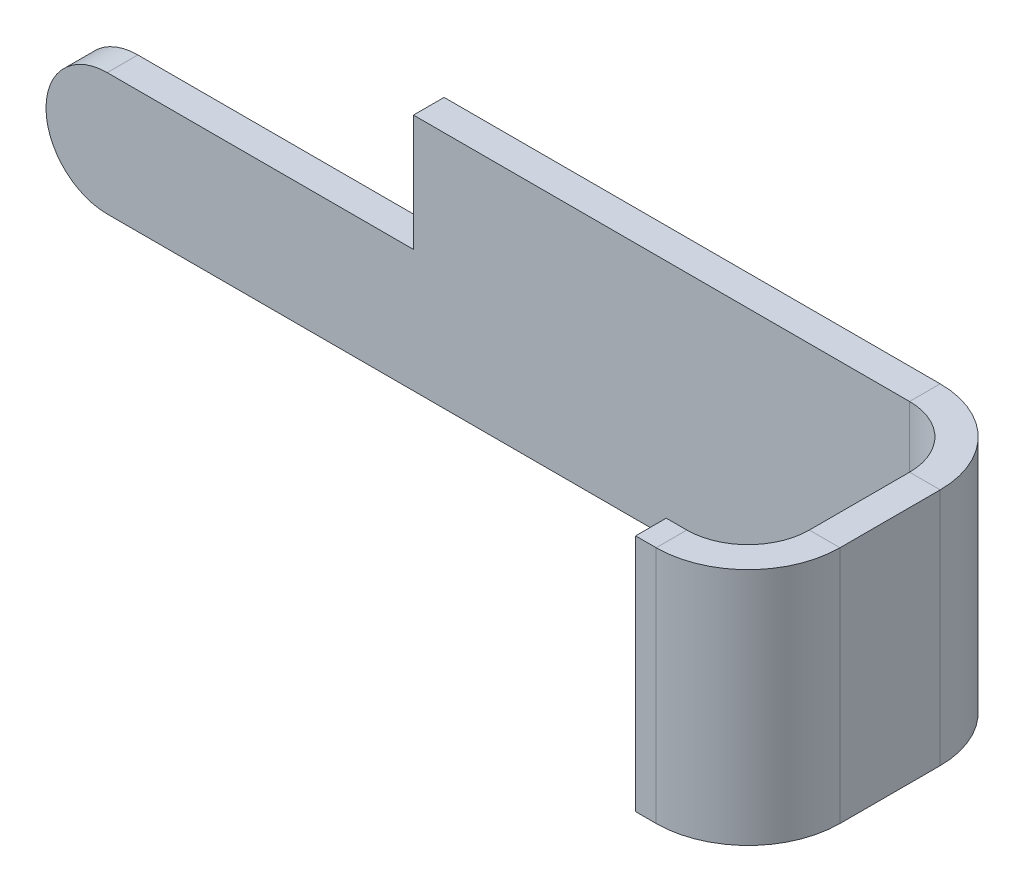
ISO-10303-21;
HEADER;
FILE_DESCRIPTION(('STEP AP214'),'2;1');
FILE_NAME('part.step','',(''),(''),'','','');
FILE_SCHEMA(('AUTOMOTIVE_DESIGN { 1 0 10303 214 1 1 1 1 }'));
ENDSEC;
DATA;
#1=APPLICATION_CONTEXT('core data for automotive mechanical design processes');
#2=APPLICATION_PROTOCOL_DEFINITION('international standard','automotive_design',2000,#1);
#3=PRODUCT_CONTEXT('',#1,'mechanical');
#4=PRODUCT('Part','Part','',(#3));
#5=PRODUCT_RELATED_PRODUCT_CATEGORY('part','',(#4));
#6=PRODUCT_DEFINITION_FORMATION('','',#4);
#7=PRODUCT_DEFINITION_CONTEXT('part definition',#1,'design');
#8=PRODUCT_DEFINITION('design','',#6,#7);
#9=PRODUCT_DEFINITION_SHAPE('','',#8);
#10=(LENGTH_UNIT() NAMED_UNIT(*) SI_UNIT(.MILLI.,.METRE.));
#11=(NAMED_UNIT(*) PLANE_ANGLE_UNIT() SI_UNIT($,.RADIAN.));
#12=(NAMED_UNIT(*) SI_UNIT($,.STERADIAN.) SOLID_ANGLE_UNIT());
#13=UNCERTAINTY_MEASURE_WITH_UNIT(LENGTH_MEASURE(1.E-05),#10,'distance_accuracy_value','');
#14=(GEOMETRIC_REPRESENTATION_CONTEXT(3) GLOBAL_UNCERTAINTY_ASSIGNED_CONTEXT((#13)) GLOBAL_UNIT_ASSIGNED_CONTEXT((#10,
#11,#12)) REPRESENTATION_CONTEXT('',''));
#15=CARTESIAN_POINT('',(0.,0.,0.));
#16=DIRECTION('',(0.,0.,1.));
#17=DIRECTION('',(1.,0.,0.));
#18=AXIS2_PLACEMENT_3D('',#15,#16,#17);
#19=CARTESIAN_POINT('',(6.81398601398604,0.,-6.54573371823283));
#20=DIRECTION('',(1.,0.,0.));
#21=DIRECTION('',(0.,0.,-1.));
#22=AXIS2_PLACEMENT_3D('',#19,#20,#21);
#23=PLANE('',#22);
#24=DIRECTION('',(0.,0.,-1.));
#25=VECTOR('',#24,1.);
#26=CARTESIAN_POINT('',(6.81398601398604,1.95,-4.53174770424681));
#27=LINE('',#26,#25);
#28=CARTESIAN_POINT('',(6.81398601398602,1.95,1.31825229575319));
#29=VERTEX_POINT('',#28);
#30=CARTESIAN_POINT('',(6.81398601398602,1.95,0.500000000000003));
#31=VERTEX_POINT('',#30);
#32=EDGE_CURVE('E283',#29,#31,#27,.T.);
#33=ORIENTED_EDGE('',*,*,#32,.F.);
#34=DIRECTION('',(0.,-1.,0.));
#35=VECTOR('',#34,1.);
#36=CARTESIAN_POINT('',(6.81398601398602,0.,1.31825229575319));
#37=LINE('',#36,#35);
#38=CARTESIAN_POINT('',(6.81398601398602,0.,1.31825229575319));
#39=VERTEX_POINT('',#38);
#40=EDGE_CURVE('E295',#29,#39,#37,.T.);
#41=ORIENTED_EDGE('',*,*,#40,.T.);
#42=DIRECTION('',(0.,0.,1.));
#43=VECTOR('',#42,1.);
#44=CARTESIAN_POINT('',(6.81398601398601,0.,2.46825229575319));
#45=LINE('',#44,#43);
#46=CARTESIAN_POINT('',(6.81398601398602,0.,0.500000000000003));
#47=VERTEX_POINT('',#46);
#48=EDGE_CURVE('E311',#47,#39,#45,.T.);
#49=ORIENTED_EDGE('',*,*,#48,.F.);
#50=DIRECTION('',(0.,-1.,0.));
#51=VECTOR('',#50,1.);
#52=CARTESIAN_POINT('',(6.81398601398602,0.,0.500000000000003));
#53=LINE('',#52,#51);
#54=EDGE_CURVE('E278',#31,#47,#53,.T.);
#55=ORIENTED_EDGE('',*,*,#54,.F.);
#56=EDGE_LOOP('',(#33,#41,#49,#55));
#57=FACE_BOUND('',#56,.T.);
#58=ADVANCED_FACE('F49',(#57),#23,.T.);
#59=CARTESIAN_POINT('',(6.81398601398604,1.95,-4.53174770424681));
#60=DIRECTION('',(0.,1.,0.));
#61=DIRECTION('',(-1.,0.,0.));
#62=AXIS2_PLACEMENT_3D('',#59,#60,#61);
#63=PLANE('',#62);
#64=DIRECTION('',(0.,0.,-1.));
#65=VECTOR('',#64,1.);
#66=CARTESIAN_POINT('',(6.56398601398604,1.95,-4.53174770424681));
#67=LINE('',#66,#65);
#68=CARTESIAN_POINT('',(6.56398601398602,1.95,1.31825229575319));
#69=VERTEX_POINT('',#68);
#70=CARTESIAN_POINT('',(6.56398601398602,1.95,0.500000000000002));
#71=VERTEX_POINT('',#70);
#72=EDGE_CURVE('E232',#69,#71,#67,.T.);
#73=ORIENTED_EDGE('',*,*,#72,.F.);
#74=DIRECTION('',(1.,0.,0.));
#75=VECTOR('',#74,1.);
#76=CARTESIAN_POINT('',(6.81398601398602,1.95,1.31825229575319));
#77=LINE('',#76,#75);
#78=EDGE_CURVE('E299',#69,#29,#77,.T.);
#79=ORIENTED_EDGE('',*,*,#78,.T.);
#80=ORIENTED_EDGE('',*,*,#32,.T.);
#81=DIRECTION('',(1.,0.,0.));
#82=VECTOR('',#81,1.);
#83=CARTESIAN_POINT('',(6.81398601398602,1.95,0.500000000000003));
#84=LINE('',#83,#82);
#85=EDGE_CURVE('E291',#71,#31,#84,.T.);
#86=ORIENTED_EDGE('',*,*,#85,.F.);
#87=EDGE_LOOP('',(#73,#79,#80,#86));
#88=FACE_BOUND('',#87,.T.);
#89=ADVANCED_FACE('F367',(#88),#63,.T.);
#90=CARTESIAN_POINT('',(6.81398601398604,0.,-6.54573371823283));
#91=DIRECTION('',(0.,-1.,0.));
#92=DIRECTION('',(0.,0.,1.));
#93=AXIS2_PLACEMENT_3D('',#90,#91,#92);
#94=PLANE('',#93);
#95=ORIENTED_EDGE('',*,*,#48,.T.);
#96=DIRECTION('',(-1.,0.,0.));
#97=VECTOR('',#96,1.);
#98=CARTESIAN_POINT('',(6.81398601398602,0.,1.31825229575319));
#99=LINE('',#98,#97);
#100=CARTESIAN_POINT('',(6.56398601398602,0.,1.31825229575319));
#101=VERTEX_POINT('',#100);
#102=EDGE_CURVE('E306',#39,#101,#99,.T.);
#103=ORIENTED_EDGE('',*,*,#102,.T.);
#104=DIRECTION('',(0.,0.,1.));
#105=VECTOR('',#104,1.);
#106=CARTESIAN_POINT('',(6.56398601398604,0.,-6.54573371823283));
#107=LINE('',#106,#105);
#108=CARTESIAN_POINT('',(6.56398601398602,0.,0.500000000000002));
#109=VERTEX_POINT('',#108);
#110=EDGE_CURVE('E315',#109,#101,#107,.T.);
#111=ORIENTED_EDGE('',*,*,#110,.F.);
#112=DIRECTION('',(-1.,0.,0.));
#113=VECTOR('',#112,1.);
#114=CARTESIAN_POINT('',(6.81398601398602,0.,0.500000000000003));
#115=LINE('',#114,#113);
#116=EDGE_CURVE('E282',#47,#109,#115,.T.);
#117=ORIENTED_EDGE('',*,*,#116,.F.);
#118=EDGE_LOOP('',(#95,#103,#111,#117));
#119=FACE_BOUND('',#118,.T.);
#120=ADVANCED_FACE('F377',(#119),#94,.T.);
#121=CARTESIAN_POINT('',(6.56398601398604,0.,-6.54573371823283));
#122=DIRECTION('',(1.,0.,0.));
#123=DIRECTION('',(0.,0.,-1.));
#124=AXIS2_PLACEMENT_3D('',#121,#122,#123);
#125=PLANE('',#124);
#126=DIRECTION('',(0.,-1.,0.));
#127=VECTOR('',#126,1.);
#128=CARTESIAN_POINT('',(6.56398601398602,0.,1.31825229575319));
#129=LINE('',#128,#127);
#130=EDGE_CURVE('E303',#69,#101,#129,.T.);
#131=ORIENTED_EDGE('',*,*,#130,.F.);
#132=ORIENTED_EDGE('',*,*,#72,.T.);
#133=DIRECTION('',(0.,-1.,0.));
#134=VECTOR('',#133,1.);
#135=CARTESIAN_POINT('',(6.56398601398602,0.,0.500000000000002));
#136=LINE('',#135,#134);
#137=EDGE_CURVE('E287',#71,#109,#136,.T.);
#138=ORIENTED_EDGE('',*,*,#137,.T.);
#139=ORIENTED_EDGE('',*,*,#110,.T.);
#140=EDGE_LOOP('',(#131,#132,#138,#139));
#141=FACE_BOUND('',#140,.T.);
#142=ADVANCED_FACE('F405',(#141),#125,.F.);
#143=CARTESIAN_POINT('',(2.01398601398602,1.,-0.25));
#144=DIRECTION('',(-1.,0.,0.));
#145=DIRECTION('',(0.,0.,1.));
#146=AXIS2_PLACEMENT_3D('',#143,#144,#145);
#147=PLANE('',#146);
#148=DIRECTION('',(0.,-1.,0.));
#149=VECTOR('',#148,1.);
#150=CARTESIAN_POINT('',(2.01398601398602,1.,0.));
#151=LINE('',#150,#149);
#152=CARTESIAN_POINT('',(2.01398601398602,1.95,0.));
#153=VERTEX_POINT('',#152);
#154=CARTESIAN_POINT('',(2.01398601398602,1.,0.));
#155=VERTEX_POINT('',#154);
#156=EDGE_CURVE('E247',#153,#155,#151,.T.);
#157=ORIENTED_EDGE('',*,*,#156,.F.);
#158=DIRECTION('',(0.,0.,1.));
#159=VECTOR('',#158,1.);
#160=CARTESIAN_POINT('',(2.01398601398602,1.95,-0.25));
#161=LINE('',#160,#159);
#162=CARTESIAN_POINT('',(2.01398601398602,1.95,-0.25));
#163=VERTEX_POINT('',#162);
#164=EDGE_CURVE('E228',#163,#153,#161,.T.);
#165=ORIENTED_EDGE('',*,*,#164,.F.);
#166=DIRECTION('',(0.,-1.,0.));
#167=VECTOR('',#166,1.);
#168=CARTESIAN_POINT('',(2.01398601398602,1.,-0.25));
#169=LINE('',#168,#167);
#170=CARTESIAN_POINT('',(2.01398601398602,1.,-0.25));
#171=VERTEX_POINT('',#170);
#172=EDGE_CURVE('E271',#163,#171,#169,.T.);
#173=ORIENTED_EDGE('',*,*,#172,.T.);
#174=DIRECTION('',(0.,0.,1.));
#175=VECTOR('',#174,1.);
#176=CARTESIAN_POINT('',(2.01398601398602,1.,-0.25));
#177=LINE('',#176,#175);
#178=EDGE_CURVE('E268',#171,#155,#177,.T.);
#179=ORIENTED_EDGE('',*,*,#178,.T.);
#180=EDGE_LOOP('',(#157,#165,#173,#179));
#181=FACE_BOUND('',#180,.T.);
#182=ADVANCED_FACE('F407',(#181),#147,.T.);
#183=CARTESIAN_POINT('',(-0.986013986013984,1.,-0.25));
#184=DIRECTION('',(0.,1.,0.));
#185=DIRECTION('',(0.,0.,1.));
#186=AXIS2_PLACEMENT_3D('',#183,#184,#185);
#187=PLANE('',#186);
#188=DIRECTION('',(-1.,0.,0.));
#189=VECTOR('',#188,1.);
#190=CARTESIAN_POINT('',(-0.986013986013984,1.,-0.25));
#191=LINE('',#190,#189);
#192=CARTESIAN_POINT('',(-0.486013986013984,1.,-0.25));
#193=VERTEX_POINT('',#192);
#194=EDGE_CURVE('E265',#171,#193,#191,.T.);
#195=ORIENTED_EDGE('',*,*,#194,.T.);
#196=DIRECTION('',(0.,0.,1.));
#197=VECTOR('',#196,1.);
#198=CARTESIAN_POINT('',(-0.486013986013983,1.,-0.25));
#199=LINE('',#198,#197);
#200=CARTESIAN_POINT('',(-0.486013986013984,1.,0.));
#201=VERTEX_POINT('',#200);
#202=EDGE_CURVE('E12',#193,#201,#199,.T.);
#203=ORIENTED_EDGE('',*,*,#202,.T.);
#204=DIRECTION('',(-1.,0.,0.));
#205=VECTOR('',#204,1.);
#206=CARTESIAN_POINT('',(-0.986013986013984,1.,0.));
#207=LINE('',#206,#205);
#208=EDGE_CURVE('E243',#155,#201,#207,.T.);
#209=ORIENTED_EDGE('',*,*,#208,.F.);
#210=ORIENTED_EDGE('',*,*,#178,.F.);
#211=EDGE_LOOP('',(#195,#203,#209,#210));
#212=FACE_BOUND('',#211,.T.);
#213=ADVANCED_FACE('F413',(#212),#187,.T.);
#214=CARTESIAN_POINT('',(0.,0.,-0.25));
#215=DIRECTION('',(0.,0.,-1.));
#216=DIRECTION('',(-1.,0.,0.));
#217=AXIS2_PLACEMENT_3D('',#214,#215,#216);
#218=PLANE('',#217);
#219=DIRECTION('',(1.,0.,0.));
#220=VECTOR('',#219,1.);
#221=CARTESIAN_POINT('',(9.01398601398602,0.,-0.25));
#222=LINE('',#221,#220);
#223=CARTESIAN_POINT('',(-0.486013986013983,0.,-0.25));
#224=VERTEX_POINT('',#223);
#225=CARTESIAN_POINT('',(6.06398601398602,0.,-0.25));
#226=VERTEX_POINT('',#225);
#227=EDGE_CURVE('E258',#224,#226,#222,.T.);
#228=ORIENTED_EDGE('',*,*,#227,.F.);
#229=CARTESIAN_POINT('',(-0.486013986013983,0.5,-0.25));
#230=DIRECTION('',(0.,0.,-1.));
#231=DIRECTION('',(-1.,0.,0.));
#232=AXIS2_PLACEMENT_3D('',#229,#230,#231);
#233=CIRCLE('',#232,0.5);
#234=CARTESIAN_POINT('',(-0.986013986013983,0.5,-0.25));
#235=VERTEX_POINT('',#234);
#236=EDGE_CURVE('E59',#224,#235,#233,.T.);
#237=ORIENTED_EDGE('',*,*,#236,.T.);
#238=CARTESIAN_POINT('',(-0.486013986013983,0.5,-0.25));
#239=DIRECTION('',(0.,0.,-1.));
#240=DIRECTION('',(-1.,0.,0.));
#241=AXIS2_PLACEMENT_3D('',#238,#239,#240);
#242=CIRCLE('',#241,0.5);
#243=EDGE_CURVE('E66',#235,#193,#242,.T.);
#244=ORIENTED_EDGE('',*,*,#243,.T.);
#245=ORIENTED_EDGE('',*,*,#194,.F.);
#246=ORIENTED_EDGE('',*,*,#172,.F.);
#247=DIRECTION('',(-1.,0.,0.));
#248=VECTOR('',#247,1.);
#249=CARTESIAN_POINT('',(2.01398601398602,1.95,-0.25));
#250=LINE('',#249,#248);
#251=CARTESIAN_POINT('',(6.06398601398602,1.95,-0.25));
#252=VERTEX_POINT('',#251);
#253=EDGE_CURVE('E233',#252,#163,#250,.T.);
#254=ORIENTED_EDGE('',*,*,#253,.F.);
#255=DIRECTION('',(0.,-1.,0.));
#256=VECTOR('',#255,1.);
#257=CARTESIAN_POINT('',(6.06398601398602,0.,-0.25));
#258=LINE('',#257,#256);
#259=EDGE_CURVE('E261',#252,#226,#258,.T.);
#260=ORIENTED_EDGE('',*,*,#259,.T.);
#261=EDGE_LOOP('',(#228,#237,#244,#245,#246,#254,#260));
#262=FACE_BOUND('',#261,.T.);
#263=ADVANCED_FACE('F390',(#262),#218,.T.);
#264=CARTESIAN_POINT('',(0.,0.,-0.25));
#265=DIRECTION('',(0.,-1.,0.));
#266=DIRECTION('',(1.,0.,0.));
#267=AXIS2_PLACEMENT_3D('',#264,#265,#266);
#268=PLANE('',#267);
#269=DIRECTION('',(1.,0.,0.));
#270=VECTOR('',#269,1.);
#271=CARTESIAN_POINT('',(0.,0.,0.));
#272=LINE('',#271,#270);
#273=CARTESIAN_POINT('',(-0.486013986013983,0.,0.));
#274=VERTEX_POINT('',#273);
#275=CARTESIAN_POINT('',(6.06398601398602,0.,0.));
#276=VERTEX_POINT('',#275);
#277=EDGE_CURVE('E240',#274,#276,#272,.T.);
#278=ORIENTED_EDGE('',*,*,#277,.F.);
#279=DIRECTION('',(0.,0.,1.));
#280=VECTOR('',#279,1.);
#281=CARTESIAN_POINT('',(-0.486013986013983,0.,-0.25));
#282=LINE('',#281,#280);
#283=EDGE_CURVE('E328',#274,#224,#282,.F.);
#284=ORIENTED_EDGE('',*,*,#283,.T.);
#285=ORIENTED_EDGE('',*,*,#227,.T.);
#286=DIRECTION('',(0.,0.,1.));
#287=VECTOR('',#286,1.);
#288=CARTESIAN_POINT('',(6.06398601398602,0.,-0.25));
#289=LINE('',#288,#287);
#290=EDGE_CURVE('E254',#226,#276,#289,.T.);
#291=ORIENTED_EDGE('',*,*,#290,.T.);
#292=EDGE_LOOP('',(#278,#284,#285,#291));
#293=FACE_BOUND('',#292,.T.);
#294=ADVANCED_FACE('F388',(#293),#268,.T.);
#295=CARTESIAN_POINT('',(0.,0.,0.));
#296=DIRECTION('',(0.,0.,-1.));
#297=DIRECTION('',(-1.,0.,0.));
#298=AXIS2_PLACEMENT_3D('',#295,#296,#297);
#299=PLANE('',#298);
#300=CARTESIAN_POINT('',(-0.486013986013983,0.5,0.));
#301=DIRECTION('',(0.,0.,-1.));
#302=DIRECTION('',(-1.,0.,0.));
#303=AXIS2_PLACEMENT_3D('',#300,#301,#302);
#304=CIRCLE('',#303,0.5);
#305=CARTESIAN_POINT('',(-0.986013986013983,0.5,0.));
#306=VERTEX_POINT('',#305);
#307=EDGE_CURVE('E310',#201,#306,#304,.F.);
#308=ORIENTED_EDGE('',*,*,#307,.T.);
#309=CARTESIAN_POINT('',(-0.486013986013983,0.5,0.));
#310=DIRECTION('',(0.,0.,-1.));
#311=DIRECTION('',(-1.,0.,0.));
#312=AXIS2_PLACEMENT_3D('',#309,#310,#311);
#313=CIRCLE('',#312,0.5);
#314=EDGE_CURVE('E325',#306,#274,#313,.F.);
#315=ORIENTED_EDGE('',*,*,#314,.T.);
#316=ORIENTED_EDGE('',*,*,#277,.T.);
#317=DIRECTION('',(0.,-1.,0.));
#318=VECTOR('',#317,1.);
#319=CARTESIAN_POINT('',(6.06398601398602,0.,0.));
#320=LINE('',#319,#318);
#321=CARTESIAN_POINT('',(6.06398601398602,1.95,0.));
#322=VERTEX_POINT('',#321);
#323=EDGE_CURVE('E221',#322,#276,#320,.T.);
#324=ORIENTED_EDGE('',*,*,#323,.F.);
#325=DIRECTION('',(-1.,0.,0.));
#326=VECTOR('',#325,1.);
#327=CARTESIAN_POINT('',(2.01398601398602,1.95,0.));
#328=LINE('',#327,#326);
#329=EDGE_CURVE('E251',#322,#153,#328,.T.);
#330=ORIENTED_EDGE('',*,*,#329,.T.);
#331=ORIENTED_EDGE('',*,*,#156,.T.);
#332=ORIENTED_EDGE('',*,*,#208,.T.);
#333=EDGE_LOOP('',(#308,#315,#316,#324,#330,#331,#332));
#334=FACE_BOUND('',#333,.T.);
#335=ADVANCED_FACE('F426',(#334),#299,.F.);
#336=CARTESIAN_POINT('',(2.01398601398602,1.95,-0.25));
#337=DIRECTION('',(0.,1.,0.));
#338=DIRECTION('',(0.,0.,1.));
#339=AXIS2_PLACEMENT_3D('',#336,#337,#338);
#340=PLANE('',#339);
#341=ORIENTED_EDGE('',*,*,#329,.F.);
#342=DIRECTION('',(0.,0.,-1.));
#343=VECTOR('',#342,1.);
#344=CARTESIAN_POINT('',(6.06398601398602,1.95,-0.25));
#345=LINE('',#344,#343);
#346=EDGE_CURVE('E236',#322,#252,#345,.T.);
#347=ORIENTED_EDGE('',*,*,#346,.T.);
#348=ORIENTED_EDGE('',*,*,#253,.T.);
#349=ORIENTED_EDGE('',*,*,#164,.T.);
#350=EDGE_LOOP('',(#341,#347,#348,#349));
#351=FACE_BOUND('',#350,.T.);
#352=ADVANCED_FACE('F396',(#351),#340,.T.);
#353=CARTESIAN_POINT('',(6.06398601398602,1.95,0.5));
#354=DIRECTION('',(0.,1.,0.));
#355=DIRECTION('',(0.,0.,1.));
#356=AXIS2_PLACEMENT_3D('',#353,#354,#355);
#357=PLANE('',#356);
#358=ORIENTED_EDGE('',*,*,#346,.F.);
#359=CARTESIAN_POINT('',(6.06398601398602,1.95,0.5));
#360=DIRECTION('',(0.,-1.,0.));
#361=DIRECTION('',(0.,0.,-1.));
#362=AXIS2_PLACEMENT_3D('',#359,#360,#361);
#363=CIRCLE('',#362,0.5);
#364=EDGE_CURVE('E205',#322,#71,#363,.T.);
#365=ORIENTED_EDGE('',*,*,#364,.T.);
#366=ORIENTED_EDGE('',*,*,#85,.T.);
#367=CARTESIAN_POINT('',(6.06398601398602,1.95,0.5));
#368=DIRECTION('',(0.,-1.,0.));
#369=DIRECTION('',(0.,0.,1.));
#370=AXIS2_PLACEMENT_3D('',#367,#368,#369);
#371=CIRCLE('',#370,0.75);
#372=EDGE_CURVE('E212',#252,#31,#371,.T.);
#373=ORIENTED_EDGE('',*,*,#372,.F.);
#374=EDGE_LOOP('',(#358,#365,#366,#373));
#375=FACE_BOUND('',#374,.T.);
#376=ADVANCED_FACE('F400',(#375),#357,.T.);
#377=CARTESIAN_POINT('',(6.06398601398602,0.,0.5));
#378=DIRECTION('',(0.,-1.,0.));
#379=DIRECTION('',(0.,0.,-1.));
#380=AXIS2_PLACEMENT_3D('',#377,#378,#379);
#381=PLANE('',#380);
#382=ORIENTED_EDGE('',*,*,#116,.T.);
#383=CARTESIAN_POINT('',(6.06398601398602,0.,0.5));
#384=DIRECTION('',(0.,-1.,0.));
#385=DIRECTION('',(0.,0.,-1.));
#386=AXIS2_PLACEMENT_3D('',#383,#384,#385);
#387=CIRCLE('',#386,0.5);
#388=EDGE_CURVE('E217',#109,#276,#387,.F.);
#389=ORIENTED_EDGE('',*,*,#388,.T.);
#390=ORIENTED_EDGE('',*,*,#290,.F.);
#391=CARTESIAN_POINT('',(6.06398601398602,0.,0.5));
#392=DIRECTION('',(0.,1.,0.));
#393=DIRECTION('',(0.,0.,-1.));
#394=AXIS2_PLACEMENT_3D('',#391,#392,#393);
#395=CIRCLE('',#394,0.75);
#396=EDGE_CURVE('E216',#47,#226,#395,.T.);
#397=ORIENTED_EDGE('',*,*,#396,.F.);
#398=EDGE_LOOP('',(#382,#389,#390,#397));
#399=FACE_BOUND('',#398,.T.);
#400=ADVANCED_FACE('F384',(#399),#381,.T.);
#401=CARTESIAN_POINT('',(6.06398601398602,3.17245956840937,0.5));
#402=DIRECTION('',(0.,-1.,0.));
#403=DIRECTION('',(0.,0.,-1.));
#404=AXIS2_PLACEMENT_3D('',#401,#402,#403);
#405=CYLINDRICAL_SURFACE('',#404,0.75);
#406=ORIENTED_EDGE('',*,*,#396,.T.);
#407=ORIENTED_EDGE('',*,*,#259,.F.);
#408=ORIENTED_EDGE('',*,*,#372,.T.);
#409=ORIENTED_EDGE('',*,*,#54,.T.);
#410=EDGE_LOOP('',(#406,#407,#408,#409));
#411=FACE_BOUND('',#410,.T.);
#412=ADVANCED_FACE('F380',(#411),#405,.T.);
#413=CARTESIAN_POINT('',(6.06398601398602,3.17245956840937,0.5));
#414=DIRECTION('',(0.,-1.,0.));
#415=DIRECTION('',(0.,0.,-1.));
#416=AXIS2_PLACEMENT_3D('',#413,#414,#415);
#417=CYLINDRICAL_SURFACE('',#416,0.5);
#418=ORIENTED_EDGE('',*,*,#388,.F.);
#419=ORIENTED_EDGE('',*,*,#137,.F.);
#420=ORIENTED_EDGE('',*,*,#364,.F.);
#421=ORIENTED_EDGE('',*,*,#323,.T.);
#422=EDGE_LOOP('',(#418,#419,#420,#421));
#423=FACE_BOUND('',#422,.T.);
#424=ADVANCED_FACE('F403',(#423),#417,.F.);
#425=CARTESIAN_POINT('',(6.06398601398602,1.95,1.31825229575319));
#426=DIRECTION('',(0.,1.,0.));
#427=DIRECTION('',(0.,0.,1.));
#428=AXIS2_PLACEMENT_3D('',#425,#426,#427);
#429=PLANE('',#428);
#430=ORIENTED_EDGE('',*,*,#78,.F.);
#431=CARTESIAN_POINT('',(6.06398601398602,1.95,1.31825229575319));
#432=DIRECTION('',(0.,-1.,0.));
#433=DIRECTION('',(0.,0.,-1.));
#434=AXIS2_PLACEMENT_3D('',#431,#432,#433);
#435=CIRCLE('',#434,0.5);
#436=CARTESIAN_POINT('',(6.06398601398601,1.95,1.81825229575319));
#437=VERTEX_POINT('',#436);
#438=EDGE_CURVE('E174',#69,#437,#435,.T.);
#439=ORIENTED_EDGE('',*,*,#438,.T.);
#440=DIRECTION('',(0.,0.,1.));
#441=VECTOR('',#440,1.);
#442=CARTESIAN_POINT('',(6.06398601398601,1.95,2.06825229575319));
#443=LINE('',#442,#441);
#444=CARTESIAN_POINT('',(6.06398601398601,1.95,2.06825229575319));
#445=VERTEX_POINT('',#444);
#446=EDGE_CURVE('E182',#437,#445,#443,.T.);
#447=ORIENTED_EDGE('',*,*,#446,.T.);
#448=CARTESIAN_POINT('',(6.06398601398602,1.95,1.31825229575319));
#449=DIRECTION('',(0.,-1.,0.));
#450=DIRECTION('',(0.,0.,1.));
#451=AXIS2_PLACEMENT_3D('',#448,#449,#450);
#452=CIRCLE('',#451,0.75);
#453=EDGE_CURVE('E196',#29,#445,#452,.T.);
#454=ORIENTED_EDGE('',*,*,#453,.F.);
#455=EDGE_LOOP('',(#430,#439,#447,#454));
#456=FACE_BOUND('',#455,.T.);
#457=ADVANCED_FACE('F354',(#456),#429,.T.);
#458=CARTESIAN_POINT('',(6.06398601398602,0.,1.31825229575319));
#459=DIRECTION('',(0.,-1.,0.));
#460=DIRECTION('',(0.,0.,-1.));
#461=AXIS2_PLACEMENT_3D('',#458,#459,#460);
#462=PLANE('',#461);
#463=DIRECTION('',(0.,0.,-1.));
#464=VECTOR('',#463,1.);
#465=CARTESIAN_POINT('',(6.06398601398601,0.,2.06825229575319));
#466=LINE('',#465,#464);
#467=CARTESIAN_POINT('',(6.06398601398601,0.,2.06825229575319));
#468=VERTEX_POINT('',#467);
#469=CARTESIAN_POINT('',(6.06398601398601,0.,1.81825229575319));
#470=VERTEX_POINT('',#469);
#471=EDGE_CURVE('E161',#468,#470,#466,.T.);
#472=ORIENTED_EDGE('',*,*,#471,.T.);
#473=CARTESIAN_POINT('',(6.06398601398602,0.,1.31825229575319));
#474=DIRECTION('',(0.,-1.,0.));
#475=DIRECTION('',(0.,0.,-1.));
#476=AXIS2_PLACEMENT_3D('',#473,#474,#475);
#477=CIRCLE('',#476,0.5);
#478=EDGE_CURVE('E201',#470,#101,#477,.F.);
#479=ORIENTED_EDGE('',*,*,#478,.T.);
#480=ORIENTED_EDGE('',*,*,#102,.F.);
#481=CARTESIAN_POINT('',(6.06398601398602,0.,1.31825229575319));
#482=DIRECTION('',(0.,1.,0.));
#483=DIRECTION('',(0.,0.,-1.));
#484=AXIS2_PLACEMENT_3D('',#481,#482,#483);
#485=CIRCLE('',#484,0.75);
#486=EDGE_CURVE('E200',#468,#39,#485,.T.);
#487=ORIENTED_EDGE('',*,*,#486,.F.);
#488=EDGE_LOOP('',(#472,#479,#480,#487));
#489=FACE_BOUND('',#488,.T.);
#490=ADVANCED_FACE('F375',(#489),#462,.T.);
#491=CARTESIAN_POINT('',(6.06398601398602,3.17245956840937,1.31825229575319));
#492=DIRECTION('',(0.,-1.,0.));
#493=DIRECTION('',(0.,0.,-1.));
#494=AXIS2_PLACEMENT_3D('',#491,#492,#493);
#495=CYLINDRICAL_SURFACE('',#494,0.75);
#496=ORIENTED_EDGE('',*,*,#486,.T.);
#497=ORIENTED_EDGE('',*,*,#40,.F.);
#498=ORIENTED_EDGE('',*,*,#453,.T.);
#499=DIRECTION('',(0.,-1.,0.));
#500=VECTOR('',#499,1.);
#501=CARTESIAN_POINT('',(6.06398601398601,0.,2.06825229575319));
#502=LINE('',#501,#500);
#503=EDGE_CURVE('E193',#445,#468,#502,.T.);
#504=ORIENTED_EDGE('',*,*,#503,.T.);
#505=EDGE_LOOP('',(#496,#497,#498,#504));
#506=FACE_BOUND('',#505,.T.);
#507=ADVANCED_FACE('F358',(#506),#495,.T.);
#508=CARTESIAN_POINT('',(6.06398601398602,3.17245956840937,1.31825229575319));
#509=DIRECTION('',(0.,-1.,0.));
#510=DIRECTION('',(0.,0.,-1.));
#511=AXIS2_PLACEMENT_3D('',#508,#509,#510);
#512=CYLINDRICAL_SURFACE('',#511,0.5);
#513=ORIENTED_EDGE('',*,*,#478,.F.);
#514=DIRECTION('',(0.,-1.,0.));
#515=VECTOR('',#514,1.);
#516=CARTESIAN_POINT('',(6.06398601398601,0.,1.81825229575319));
#517=LINE('',#516,#515);
#518=EDGE_CURVE('E340',#437,#470,#517,.T.);
#519=ORIENTED_EDGE('',*,*,#518,.F.);
#520=ORIENTED_EDGE('',*,*,#438,.F.);
#521=ORIENTED_EDGE('',*,*,#130,.T.);
#522=EDGE_LOOP('',(#513,#519,#520,#521));
#523=FACE_BOUND('',#522,.T.);
#524=ADVANCED_FACE('F371',(#523),#512,.F.);
#525=CARTESIAN_POINT('',(5.89573371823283,1.95,2.06825229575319));
#526=DIRECTION('',(-1.,0.,0.));
#527=DIRECTION('',(0.,0.,1.));
#528=AXIS2_PLACEMENT_3D('',#525,#526,#527);
#529=PLANE('',#528);
#530=DIRECTION('',(0.,1.,0.));
#531=VECTOR('',#530,1.);
#532=CARTESIAN_POINT('',(5.89573371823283,1.95,1.81825229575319));
#533=LINE('',#532,#531);
#534=CARTESIAN_POINT('',(5.89573371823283,0.,1.81825229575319));
#535=VERTEX_POINT('',#534);
#536=CARTESIAN_POINT('',(5.89573371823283,1.95,1.81825229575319));
#537=VERTEX_POINT('',#536);
#538=EDGE_CURVE('E166',#535,#537,#533,.T.);
#539=ORIENTED_EDGE('',*,*,#538,.F.);
#540=DIRECTION('',(0.,0.,-1.));
#541=VECTOR('',#540,1.);
#542=CARTESIAN_POINT('',(5.89573371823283,0.,2.06825229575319));
#543=LINE('',#542,#541);
#544=CARTESIAN_POINT('',(5.89573371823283,0.,2.06825229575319));
#545=VERTEX_POINT('',#544);
#546=EDGE_CURVE('E158',#545,#535,#543,.T.);
#547=ORIENTED_EDGE('',*,*,#546,.F.);
#548=DIRECTION('',(0.,1.,0.));
#549=VECTOR('',#548,1.);
#550=CARTESIAN_POINT('',(5.89573371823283,1.95,2.06825229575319));
#551=LINE('',#550,#549);
#552=CARTESIAN_POINT('',(5.89573371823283,1.95,2.06825229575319));
#553=VERTEX_POINT('',#552);
#554=EDGE_CURVE('E171',#545,#553,#551,.T.);
#555=ORIENTED_EDGE('',*,*,#554,.T.);
#556=DIRECTION('',(0.,0.,-1.));
#557=VECTOR('',#556,1.);
#558=CARTESIAN_POINT('',(5.89573371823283,1.95,2.06825229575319));
#559=LINE('',#558,#557);
#560=EDGE_CURVE('E181',#553,#537,#559,.T.);
#561=ORIENTED_EDGE('',*,*,#560,.T.);
#562=EDGE_LOOP('',(#539,#547,#555,#561));
#563=FACE_BOUND('',#562,.T.);
#564=ADVANCED_FACE('F170',(#563),#529,.T.);
#565=CARTESIAN_POINT('',(14.9097197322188,0.,2.06825229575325));
#566=DIRECTION('',(0.,0.,1.));
#567=DIRECTION('',(1.,0.,0.));
#568=AXIS2_PLACEMENT_3D('',#565,#566,#567);
#569=PLANE('',#568);
#570=ORIENTED_EDGE('',*,*,#503,.F.);
#571=DIRECTION('',(1.,0.,0.));
#572=VECTOR('',#571,1.);
#573=CARTESIAN_POINT('',(12.8957337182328,1.95,2.06825229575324));
#574=LINE('',#573,#572);
#575=EDGE_CURVE('E179',#553,#445,#574,.T.);
#576=ORIENTED_EDGE('',*,*,#575,.F.);
#577=ORIENTED_EDGE('',*,*,#554,.F.);
#578=DIRECTION('',(-1.,0.,0.));
#579=VECTOR('',#578,1.);
#580=CARTESIAN_POINT('',(5.89573371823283,0.,2.06825229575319));
#581=LINE('',#580,#579);
#582=EDGE_CURVE('E155',#468,#545,#581,.T.);
#583=ORIENTED_EDGE('',*,*,#582,.F.);
#584=EDGE_LOOP('',(#570,#576,#577,#583));
#585=FACE_BOUND('',#584,.T.);
#586=ADVANCED_FACE('F177',(#585),#569,.T.);
#587=CARTESIAN_POINT('',(12.8957337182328,1.95,2.06825229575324));
#588=DIRECTION('',(0.,1.,0.));
#589=DIRECTION('',(0.,0.,-1.));
#590=AXIS2_PLACEMENT_3D('',#587,#588,#589);
#591=PLANE('',#590);
#592=ORIENTED_EDGE('',*,*,#446,.F.);
#593=DIRECTION('',(1.,0.,0.));
#594=VECTOR('',#593,1.);
#595=CARTESIAN_POINT('',(12.8957337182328,1.95,1.81825229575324));
#596=LINE('',#595,#594);
#597=EDGE_CURVE('E344',#537,#437,#596,.T.);
#598=ORIENTED_EDGE('',*,*,#597,.F.);
#599=ORIENTED_EDGE('',*,*,#560,.F.);
#600=ORIENTED_EDGE('',*,*,#575,.T.);
#601=EDGE_LOOP('',(#592,#598,#599,#600));
#602=FACE_BOUND('',#601,.T.);
#603=ADVANCED_FACE('F350',(#602),#591,.T.);
#604=CARTESIAN_POINT('',(14.9097197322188,0.,1.81825229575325));
#605=DIRECTION('',(0.,0.,1.));
#606=DIRECTION('',(1.,0.,0.));
#607=AXIS2_PLACEMENT_3D('',#604,#605,#606);
#608=PLANE('',#607);
#609=ORIENTED_EDGE('',*,*,#597,.T.);
#610=ORIENTED_EDGE('',*,*,#518,.T.);
#611=DIRECTION('',(-1.,0.,0.));
#612=VECTOR('',#611,1.);
#613=CARTESIAN_POINT('',(14.9097197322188,0.,1.81825229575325));
#614=LINE('',#613,#612);
#615=EDGE_CURVE('E337',#470,#535,#614,.T.);
#616=ORIENTED_EDGE('',*,*,#615,.T.);
#617=ORIENTED_EDGE('',*,*,#538,.T.);
#618=EDGE_LOOP('',(#609,#610,#616,#617));
#619=FACE_BOUND('',#618,.T.);
#620=ADVANCED_FACE('F373',(#619),#608,.F.);
#621=CARTESIAN_POINT('',(14.9097197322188,0.,2.06825229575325));
#622=DIRECTION('',(0.,-1.,0.));
#623=DIRECTION('',(-1.,0.,0.));
#624=AXIS2_PLACEMENT_3D('',#621,#622,#623);
#625=PLANE('',#624);
#626=ORIENTED_EDGE('',*,*,#471,.F.);
#627=ORIENTED_EDGE('',*,*,#582,.T.);
#628=ORIENTED_EDGE('',*,*,#546,.T.);
#629=ORIENTED_EDGE('',*,*,#615,.F.);
#630=EDGE_LOOP('',(#626,#627,#628,#629));
#631=FACE_BOUND('',#630,.T.);
#632=ADVANCED_FACE('F157',(#631),#625,.T.);
#633=CARTESIAN_POINT('',(-0.486013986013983,0.5,-0.25));
#634=DIRECTION('',(0.,0.,1.));
#635=DIRECTION('',(1.,0.,0.));
#636=AXIS2_PLACEMENT_3D('',#633,#634,#635);
#637=CYLINDRICAL_SURFACE('',#636,0.5);
#638=ORIENTED_EDGE('',*,*,#202,.F.);
#639=ORIENTED_EDGE('',*,*,#243,.F.);
#640=DIRECTION('',(0.,0.,1.));
#641=VECTOR('',#640,1.);
#642=CARTESIAN_POINT('',(-0.986013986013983,0.5,-0.25));
#643=LINE('',#642,#641);
#644=EDGE_CURVE('E53',#306,#235,#643,.F.);
#645=ORIENTED_EDGE('',*,*,#644,.F.);
#646=ORIENTED_EDGE('',*,*,#307,.F.);
#647=EDGE_LOOP('',(#638,#639,#645,#646));
#648=FACE_BOUND('',#647,.T.);
#649=ADVANCED_FACE('F51',(#648),#637,.T.);
#650=CARTESIAN_POINT('',(-0.486013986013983,0.5,-0.25));
#651=DIRECTION('',(0.,0.,1.));
#652=DIRECTION('',(1.,0.,0.));
#653=AXIS2_PLACEMENT_3D('',#650,#651,#652);
#654=CYLINDRICAL_SURFACE('',#653,0.5);
#655=ORIENTED_EDGE('',*,*,#236,.F.);
#656=ORIENTED_EDGE('',*,*,#283,.F.);
#657=ORIENTED_EDGE('',*,*,#314,.F.);
#658=ORIENTED_EDGE('',*,*,#644,.T.);
#659=EDGE_LOOP('',(#655,#656,#657,#658));
#660=FACE_BOUND('',#659,.T.);
#661=ADVANCED_FACE('F489',(#660),#654,.T.);
#662=CLOSED_SHELL('',(#58,#89,#120,#142,#182,#213,#263,#294,#335,#352,#376,#400,#412,#424,#457,
#490,#507,#524,#564,#586,#603,#620,#632,#649,#661));
#663=MANIFOLD_SOLID_BREP('B2',#662);
#664=ADVANCED_BREP_SHAPE_REPRESENTATION('',(#18,#663),#14);
#665=SHAPE_DEFINITION_REPRESENTATION(#9,#664);
ENDSEC;
END-ISO-10303-21;
